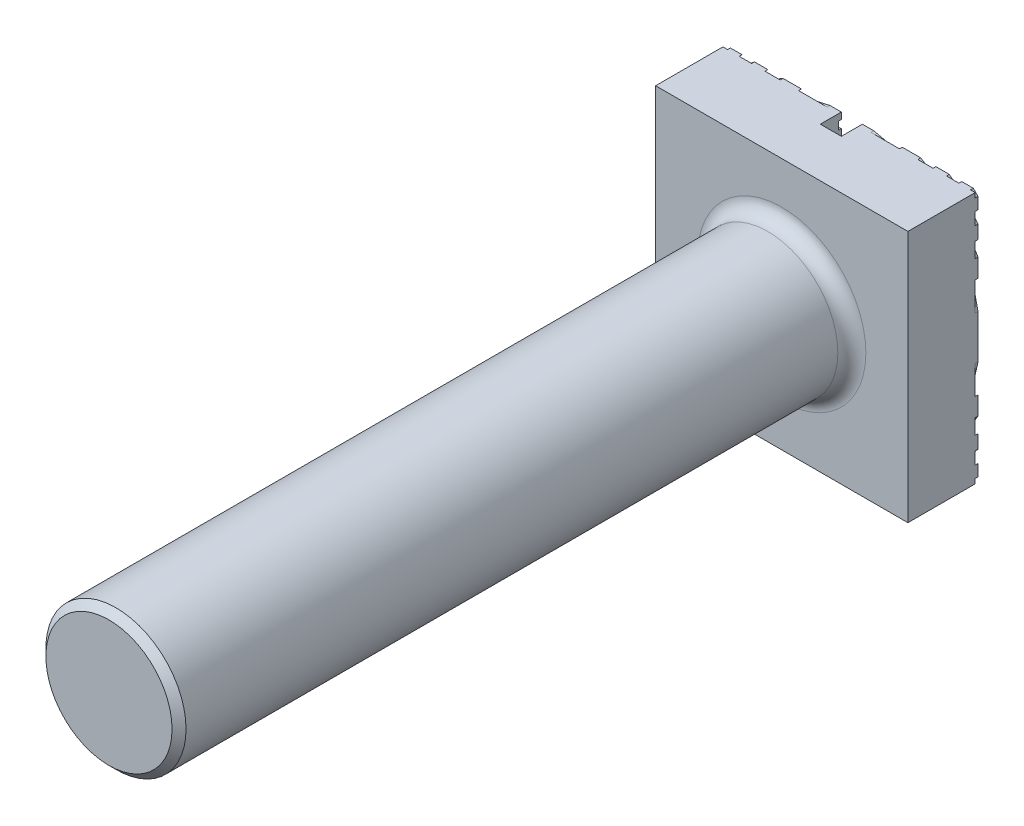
from build123d import *

# Parameters (mm, degrees)
ESQUISSE1_W             = 18
ESQUISSE1_H             = 18
EXTRUSION1_DEPTH        = 5
ESQUISSE2_R             = 5
EXTRUSION2_DEPTH        = 48
CONG_1_R                = 1
ESQUISSE3_W             = 1.5
ESQUISSE3_H             = 1.5
ENL_V_MAT_EXTRU_1_DEPTH = 53.048054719
ESQUISSE4_R             = 2
ESQUISSE4_R_2           = 1.5
ENL_V_MAT_EXTRU_2_DEPTH = 0.2
ESQUISSE6_W             = 0.2
ESQUISSE6_H             = 0.55501152
ESQUISSE6_H_2           = 0.56
CHANFREIN1_SIZE         = 0.5


with BuildPart() as part:
    # Esquisse1 → Extrusion1 (new body)
    with BuildSketch(Plane.XY):
        Rectangle(ESQUISSE1_W, ESQUISSE1_H)
    extrude(amount=-EXTRUSION1_DEPTH)

    # Esquisse2 → Extrusion2 (add)
    with BuildSketch(Plane.XY):
        Circle(ESQUISSE2_R)
    extrude(amount=EXTRUSION2_DEPTH)

    # Cong_1
    cong_1_edges = [part.edges().sort_by_distance(p)[0] for p in [
        (-5, 0, 0),
    ]]
    fillet(cong_1_edges, radius=CONG_1_R)

    # Esquisse3 → Enl_v. mat.-Extru.1 (cut, through all)
    with BuildSketch(Plane.XZ.offset(9)):
        with Locations((0, -4.25)):
            Rectangle(ESQUISSE3_W, ESQUISSE3_H)
    extrude(amount=-ENL_V_MAT_EXTRU_1_DEPTH, mode=Mode.SUBTRACT)

    # Esquisse4 → Enl_v. mat.-Extru.2 (cut)
    with BuildSketch(Plane(origin=(0, 0, -5), x_dir=(-1, 0, 0), z_dir=(0, 0, -1))):
        Circle(ESQUISSE4_R)
        Circle(ESQUISSE4_R_2, mode=Mode.SUBTRACT)
    extrude(amount=-ENL_V_MAT_EXTRU_2_DEPTH, mode=Mode.SUBTRACT)

    # Esquisse6 → Enl_vement de mati_re-R_volution2 (revolve, cut)
    with BuildSketch(Plane(origin=(0, 0, 0), x_dir=(0, 0, -1), z_dir=(1, 0, 0))):
        with Locations((4.9, 1.576543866)):
            Rectangle(ESQUISSE6_W, ESQUISSE6_H)
        with Locations((4.9, 3.814049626)):
            Rectangle(ESQUISSE6_W, ESQUISSE6_H_2)
        with Locations((4.9, 4.934049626)):
            Rectangle(ESQUISSE6_W, ESQUISSE6_H_2)
        with Locations((4.9, 6.054049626)):
            Rectangle(ESQUISSE6_W, ESQUISSE6_H_2)
        with Locations((4.9, 7.174049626)):
            Rectangle(ESQUISSE6_W, ESQUISSE6_H_2)
        with Locations((4.9, 8.294049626)):
            Rectangle(ESQUISSE6_W, ESQUISSE6_H_2)
        with Locations((4.9, 2.694049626)):
            Rectangle(ESQUISSE6_W, ESQUISSE6_H_2)
        with Locations((4.9, 9.414049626)):
            Rectangle(ESQUISSE6_W, ESQUISSE6_H_2)
        with Locations((4.9, 10.534049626)):
            Rectangle(ESQUISSE6_W, ESQUISSE6_H_2)
        with Locations((4.9, 11.654049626)):
            Rectangle(ESQUISSE6_W, ESQUISSE6_H_2)
        with Locations((4.9, 12.774049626)):
            Rectangle(ESQUISSE6_W, ESQUISSE6_H_2)
    revolve(axis=Axis((0, 0, 0), (0, 0, -1)), mode=Mode.SUBTRACT)

    # Chanfrein1
    chanfrein1_edges = [part.edges().sort_by_distance(p)[0] for p in [
        (-5, 0, 48),
    ]]
    chamfer(chanfrein1_edges, length=CHANFREIN1_SIZE)


solid = part.part
